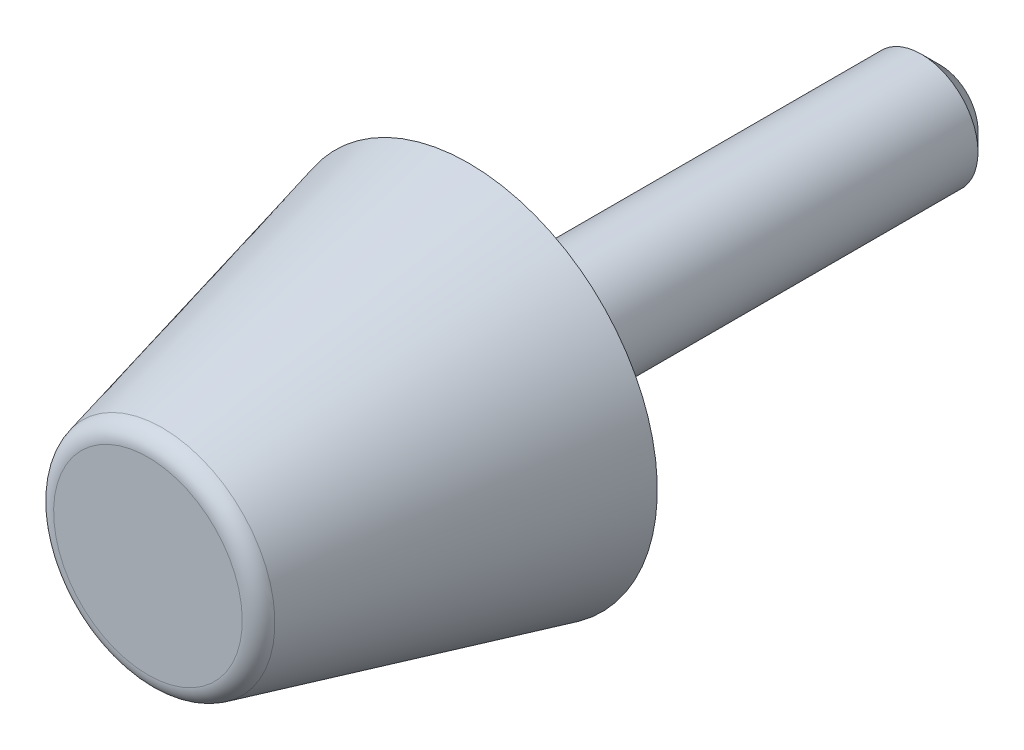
ISO-10303-21;
HEADER;
FILE_DESCRIPTION(('STEP AP214'),'2;1');
FILE_NAME('part.step','',(''),(''),'','','');
FILE_SCHEMA(('AUTOMOTIVE_DESIGN { 1 0 10303 214 1 1 1 1 }'));
ENDSEC;
DATA;
#1=APPLICATION_CONTEXT('core data for automotive mechanical design processes');
#2=APPLICATION_PROTOCOL_DEFINITION('international standard','automotive_design',2000,#1);
#3=PRODUCT_CONTEXT('',#1,'mechanical');
#4=PRODUCT('Part','Part','',(#3));
#5=PRODUCT_RELATED_PRODUCT_CATEGORY('part','',(#4));
#6=PRODUCT_DEFINITION_FORMATION('','',#4);
#7=PRODUCT_DEFINITION_CONTEXT('part definition',#1,'design');
#8=PRODUCT_DEFINITION('design','',#6,#7);
#9=PRODUCT_DEFINITION_SHAPE('','',#8);
#10=(LENGTH_UNIT() NAMED_UNIT(*) SI_UNIT(.MILLI.,.METRE.));
#11=(NAMED_UNIT(*) PLANE_ANGLE_UNIT() SI_UNIT($,.RADIAN.));
#12=(NAMED_UNIT(*) SI_UNIT($,.STERADIAN.) SOLID_ANGLE_UNIT());
#13=UNCERTAINTY_MEASURE_WITH_UNIT(LENGTH_MEASURE(1.E-05),#10,'distance_accuracy_value','');
#14=(GEOMETRIC_REPRESENTATION_CONTEXT(3) GLOBAL_UNCERTAINTY_ASSIGNED_CONTEXT((#13)) GLOBAL_UNIT_ASSIGNED_CONTEXT((#10,
#11,#12)) REPRESENTATION_CONTEXT('',''));
#15=CARTESIAN_POINT('',(0.,0.,0.));
#16=DIRECTION('',(0.,0.,1.));
#17=DIRECTION('',(1.,0.,0.));
#18=AXIS2_PLACEMENT_3D('',#15,#16,#17);
#19=CARTESIAN_POINT('',(0.,0.,17.));
#20=DIRECTION('',(0.,0.,1.));
#21=DIRECTION('',(0.,-1.,0.));
#22=AXIS2_PLACEMENT_3D('',#19,#20,#21);
#23=CYLINDRICAL_SURFACE('',#22,9.);
#24=CARTESIAN_POINT('',(0.,0.,0.));
#25=DIRECTION('',(0.,0.,1.));
#26=DIRECTION('',(0.,-1.,0.));
#27=AXIS2_PLACEMENT_3D('',#24,#25,#26);
#28=CIRCLE('',#27,9.);
#29=CARTESIAN_POINT('',(0.,-9.,0.));
#30=VERTEX_POINT('',#29);
#31=EDGE_CURVE('E27',#30,#30,#28,.T.);
#32=ORIENTED_EDGE('',*,*,#31,.F.);
#33=EDGE_LOOP('',(#32));
#34=FACE_BOUND('',#33,.T.);
#35=CARTESIAN_POINT('',(0.,0.,0.0500000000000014));
#36=DIRECTION('',(0.,0.,1.));
#37=DIRECTION('',(0.,-1.,0.));
#38=AXIS2_PLACEMENT_3D('',#35,#36,#37);
#39=CIRCLE('',#38,9.);
#40=CARTESIAN_POINT('',(0.,-9.,0.0500000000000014));
#41=VERTEX_POINT('',#40);
#42=EDGE_CURVE('E44',#41,#41,#39,.T.);
#43=ORIENTED_EDGE('',*,*,#42,.T.);
#44=EDGE_LOOP('',(#43));
#45=FACE_BOUND('',#44,.T.);
#46=ADVANCED_FACE('F12',(#34,#45),#23,.F.);
#47=CARTESIAN_POINT('',(9.,0.,0.));
#48=DIRECTION('',(0.,0.,1.));
#49=DIRECTION('',(0.,-1.,0.));
#50=AXIS2_PLACEMENT_3D('',#47,#48,#49);
#51=PLANE('',#50);
#52=CARTESIAN_POINT('',(0.,0.,0.));
#53=DIRECTION('',(0.,0.,1.));
#54=DIRECTION('',(0.,-1.,0.));
#55=AXIS2_PLACEMENT_3D('',#52,#53,#54);
#56=CIRCLE('',#55,10.);
#57=CARTESIAN_POINT('',(0.,-10.,0.));
#58=VERTEX_POINT('',#57);
#59=EDGE_CURVE('E32',#58,#58,#56,.T.);
#60=ORIENTED_EDGE('',*,*,#59,.F.);
#61=EDGE_LOOP('',(#60));
#62=FACE_BOUND('',#61,.T.);
#63=ORIENTED_EDGE('',*,*,#31,.T.);
#64=EDGE_LOOP('',(#63));
#65=FACE_BOUND('',#64,.T.);
#66=ADVANCED_FACE('F72',(#62,#65),#51,.F.);
#67=CARTESIAN_POINT('',(0.,0.,0.));
#68=DIRECTION('',(0.,0.,-1.));
#69=DIRECTION('',(0.,1.,0.));
#70=AXIS2_PLACEMENT_3D('',#67,#68,#69);
#71=CONICAL_SURFACE('',#70,10.,0.243194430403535);
#72=CARTESIAN_POINT('',(0.,0.,16.2408042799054));
#73=DIRECTION('',(0.,0.,1.));
#74=DIRECTION('',(0.,-1.,0.));
#75=AXIS2_PLACEMENT_3D('',#72,#73,#74);
#76=CIRCLE('',#75,5.97057369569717);
#77=CARTESIAN_POINT('',(0.,-5.97057369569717,16.2408042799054));
#78=VERTEX_POINT('',#77);
#79=EDGE_CURVE('E35',#78,#78,#76,.T.);
#80=ORIENTED_EDGE('',*,*,#79,.F.);
#81=EDGE_LOOP('',(#80));
#82=FACE_BOUND('',#81,.T.);
#83=ORIENTED_EDGE('',*,*,#59,.T.);
#84=EDGE_LOOP('',(#83));
#85=FACE_BOUND('',#84,.T.);
#86=ADVANCED_FACE('F77',(#82,#85),#71,.T.);
#87=CARTESIAN_POINT('',(0.,0.,16.));
#88=DIRECTION('',(0.,0.,1.));
#89=DIRECTION('',(0.,-1.,0.));
#90=AXIS2_PLACEMENT_3D('',#87,#88,#89);
#91=TOROIDAL_SURFACE('',#90,5.,1.);
#92=ORIENTED_EDGE('',*,*,#79,.T.);
#93=EDGE_LOOP('',(#92));
#94=FACE_BOUND('',#93,.T.);
#95=CARTESIAN_POINT('',(0.,0.,17.));
#96=DIRECTION('',(0.,0.,1.));
#97=DIRECTION('',(0.,-1.,0.));
#98=AXIS2_PLACEMENT_3D('',#95,#96,#97);
#99=CIRCLE('',#98,5.);
#100=CARTESIAN_POINT('',(0.,-5.,17.));
#101=VERTEX_POINT('',#100);
#102=EDGE_CURVE('E38',#101,#101,#99,.T.);
#103=ORIENTED_EDGE('',*,*,#102,.F.);
#104=EDGE_LOOP('',(#103));
#105=FACE_BOUND('',#104,.T.);
#106=ADVANCED_FACE('F84',(#94,#105),#91,.T.);
#107=CARTESIAN_POINT('',(5.,0.,17.));
#108=DIRECTION('',(0.,0.,-1.));
#109=DIRECTION('',(0.,1.,0.));
#110=AXIS2_PLACEMENT_3D('',#107,#108,#109);
#111=PLANE('',#110);
#112=ORIENTED_EDGE('',*,*,#102,.T.);
#113=EDGE_LOOP('',(#112));
#114=FACE_BOUND('',#113,.T.);
#115=ADVANCED_FACE('F59',(#114),#111,.F.);
#116=CARTESIAN_POINT('',(0.,0.,0.));
#117=DIRECTION('',(0.,0.,1.));
#118=DIRECTION('',(0.,-1.,0.));
#119=AXIS2_PLACEMENT_3D('',#116,#117,#118);
#120=PLANE('',#119);
#121=CARTESIAN_POINT('',(0.,0.,0.));
#122=DIRECTION('',(0.,0.,1.));
#123=DIRECTION('',(0.,-1.,0.));
#124=AXIS2_PLACEMENT_3D('',#121,#122,#123);
#125=CIRCLE('',#124,8.95);
#126=CARTESIAN_POINT('',(0.,-8.95,0.));
#127=VERTEX_POINT('',#126);
#128=EDGE_CURVE('E41',#127,#127,#125,.T.);
#129=ORIENTED_EDGE('',*,*,#128,.F.);
#130=EDGE_LOOP('',(#129));
#131=FACE_BOUND('',#130,.T.);
#132=CARTESIAN_POINT('',(0.,0.,0.));
#133=DIRECTION('',(0.,0.,1.));
#134=DIRECTION('',(0.,-1.,0.));
#135=AXIS2_PLACEMENT_3D('',#132,#133,#134);
#136=CIRCLE('',#135,3.);
#137=CARTESIAN_POINT('',(0.,-3.,0.));
#138=VERTEX_POINT('',#137);
#139=EDGE_CURVE('E23',#138,#138,#136,.T.);
#140=ORIENTED_EDGE('',*,*,#139,.T.);
#141=EDGE_LOOP('',(#140));
#142=FACE_BOUND('',#141,.T.);
#143=ADVANCED_FACE('F53',(#131,#142),#120,.F.);
#144=CARTESIAN_POINT('',(0.,0.,0.));
#145=DIRECTION('',(0.,0.,1.));
#146=DIRECTION('',(0.,-1.,0.));
#147=AXIS2_PLACEMENT_3D('',#144,#145,#146);
#148=CONICAL_SURFACE('',#147,8.95,0.785398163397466);
#149=ORIENTED_EDGE('',*,*,#42,.F.);
#150=EDGE_LOOP('',(#149));
#151=FACE_BOUND('',#150,.T.);
#152=ORIENTED_EDGE('',*,*,#128,.T.);
#153=EDGE_LOOP('',(#152));
#154=FACE_BOUND('',#153,.T.);
#155=ADVANCED_FACE('F49',(#151,#154),#148,.T.);
#156=CARTESIAN_POINT('',(0.,0.,17.));
#157=DIRECTION('',(0.,0.,1.));
#158=DIRECTION('',(0.,-1.,0.));
#159=AXIS2_PLACEMENT_3D('',#156,#157,#158);
#160=CYLINDRICAL_SURFACE('',#159,3.);
#161=CARTESIAN_POINT('',(0.,0.,-24.));
#162=DIRECTION('',(0.,0.,-1.));
#163=DIRECTION('',(0.,1.,0.));
#164=AXIS2_PLACEMENT_3D('',#161,#162,#163);
#165=CIRCLE('',#164,3.);
#166=CARTESIAN_POINT('',(0.,3.,-24.));
#167=VERTEX_POINT('',#166);
#168=EDGE_CURVE('E8',#167,#167,#165,.F.);
#169=ORIENTED_EDGE('',*,*,#168,.T.);
#170=EDGE_LOOP('',(#169));
#171=FACE_BOUND('',#170,.T.);
#172=ORIENTED_EDGE('',*,*,#139,.F.);
#173=EDGE_LOOP('',(#172));
#174=FACE_BOUND('',#173,.T.);
#175=ADVANCED_FACE('F52',(#171,#174),#160,.T.);
#176=CARTESIAN_POINT('',(0.,0.,-25.));
#177=DIRECTION('',(0.,0.,-1.));
#178=DIRECTION('',(0.,1.,0.));
#179=AXIS2_PLACEMENT_3D('',#176,#177,#178);
#180=PLANE('',#179);
#181=CARTESIAN_POINT('',(0.,0.,-25.));
#182=DIRECTION('',(0.,0.,-1.));
#183=DIRECTION('',(0.,1.,0.));
#184=AXIS2_PLACEMENT_3D('',#181,#182,#183);
#185=CIRCLE('',#184,2.);
#186=CARTESIAN_POINT('',(0.,2.,-25.));
#187=VERTEX_POINT('',#186);
#188=EDGE_CURVE('E19',#187,#187,#185,.T.);
#189=ORIENTED_EDGE('',*,*,#188,.T.);
#190=EDGE_LOOP('',(#189));
#191=FACE_BOUND('',#190,.T.);
#192=ADVANCED_FACE('F64',(#191),#180,.T.);
#193=CARTESIAN_POINT('',(0.,0.,-25.));
#194=DIRECTION('',(0.,0.,1.));
#195=DIRECTION('',(0.,-1.,0.));
#196=AXIS2_PLACEMENT_3D('',#193,#194,#195);
#197=CONICAL_SURFACE('',#196,2.,0.785398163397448);
#198=ORIENTED_EDGE('',*,*,#168,.F.);
#199=EDGE_LOOP('',(#198));
#200=FACE_BOUND('',#199,.T.);
#201=ORIENTED_EDGE('',*,*,#188,.F.);
#202=EDGE_LOOP('',(#201));
#203=FACE_BOUND('',#202,.T.);
#204=ADVANCED_FACE('F14',(#200,#203),#197,.T.);
#205=CLOSED_SHELL('',(#46,#66,#86,#106,#115,#143,#155,#175,#192,#204));
#206=MANIFOLD_SOLID_BREP('B1',#205);
#207=ADVANCED_BREP_SHAPE_REPRESENTATION('',(#18,#206),#14);
#208=SHAPE_DEFINITION_REPRESENTATION(#9,#207);
ENDSEC;
END-ISO-10303-21;
